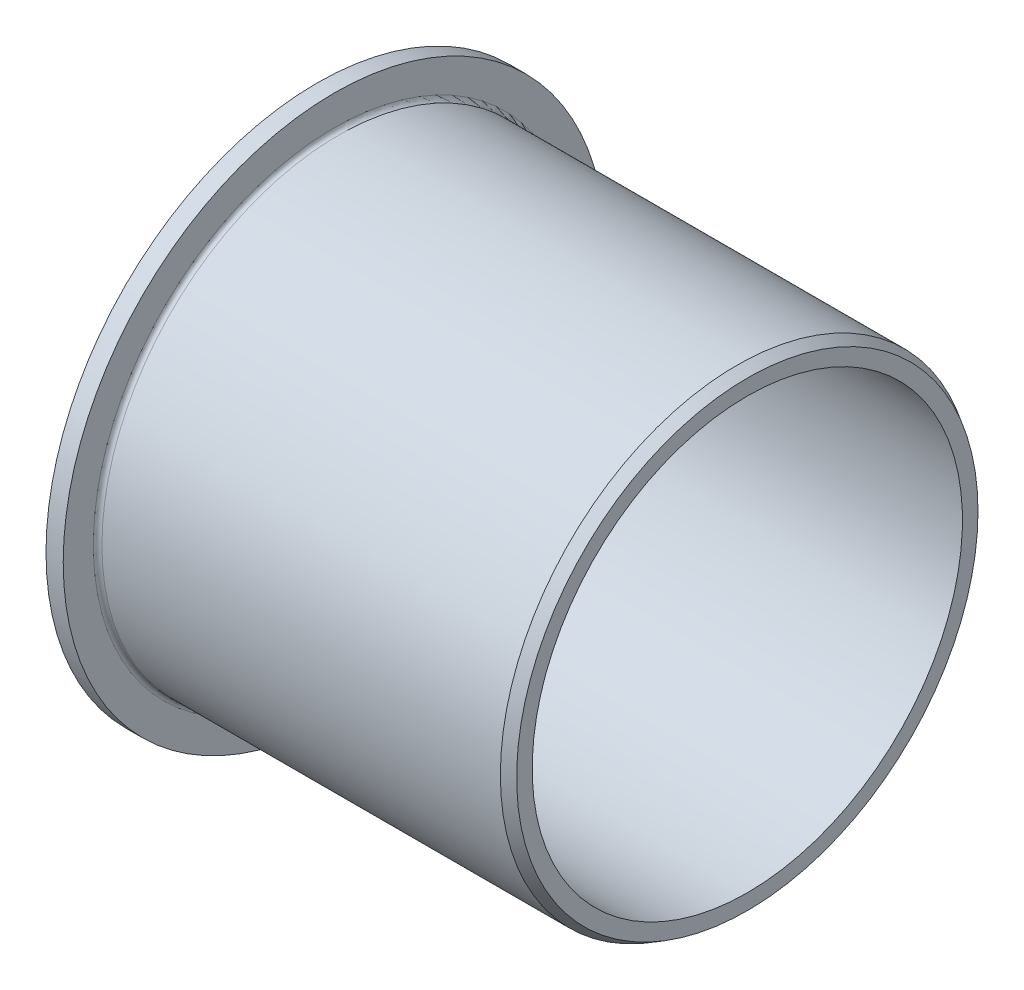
ISO-10303-21;
HEADER;
FILE_DESCRIPTION(('STEP AP214'),'2;1');
FILE_NAME('part.step','',(''),(''),'','','');
FILE_SCHEMA(('AUTOMOTIVE_DESIGN { 1 0 10303 214 1 1 1 1 }'));
ENDSEC;
DATA;
#1=APPLICATION_CONTEXT('core data for automotive mechanical design processes');
#2=APPLICATION_PROTOCOL_DEFINITION('international standard','automotive_design',2000,#1);
#3=PRODUCT_CONTEXT('',#1,'mechanical');
#4=PRODUCT('Part','Part','',(#3));
#5=PRODUCT_RELATED_PRODUCT_CATEGORY('part','',(#4));
#6=PRODUCT_DEFINITION_FORMATION('','',#4);
#7=PRODUCT_DEFINITION_CONTEXT('part definition',#1,'design');
#8=PRODUCT_DEFINITION('design','',#6,#7);
#9=PRODUCT_DEFINITION_SHAPE('','',#8);
#10=(LENGTH_UNIT() NAMED_UNIT(*) SI_UNIT(.MILLI.,.METRE.));
#11=(NAMED_UNIT(*) PLANE_ANGLE_UNIT() SI_UNIT($,.RADIAN.));
#12=(NAMED_UNIT(*) SI_UNIT($,.STERADIAN.) SOLID_ANGLE_UNIT());
#13=UNCERTAINTY_MEASURE_WITH_UNIT(LENGTH_MEASURE(1.E-05),#10,'distance_accuracy_value','');
#14=(GEOMETRIC_REPRESENTATION_CONTEXT(3) GLOBAL_UNCERTAINTY_ASSIGNED_CONTEXT((#13)) GLOBAL_UNIT_ASSIGNED_CONTEXT((#10,
#11,#12)) REPRESENTATION_CONTEXT('',''));
#15=CARTESIAN_POINT('',(0.,0.,0.));
#16=DIRECTION('',(0.,0.,1.));
#17=DIRECTION('',(1.,0.,0.));
#18=AXIS2_PLACEMENT_3D('',#15,#16,#17);
#19=CARTESIAN_POINT('',(2.,0.,0.));
#20=DIRECTION('',(1.,0.,0.));
#21=DIRECTION('',(0.,0.,1.));
#22=AXIS2_PLACEMENT_3D('',#19,#20,#21);
#23=PLANE('',#22);
#24=CARTESIAN_POINT('',(2.,0.,0.));
#25=DIRECTION('',(-1.,0.,0.));
#26=DIRECTION('',(0.,-1.,0.));
#27=AXIS2_PLACEMENT_3D('',#24,#25,#26);
#28=CIRCLE('',#27,31.5);
#29=CARTESIAN_POINT('',(2.,-31.5,0.));
#30=VERTEX_POINT('',#29);
#31=EDGE_CURVE('E21',#30,#30,#28,.T.);
#32=ORIENTED_EDGE('',*,*,#31,.F.);
#33=EDGE_LOOP('',(#32));
#34=FACE_BOUND('',#33,.T.);
#35=CARTESIAN_POINT('',(2.,0.,0.));
#36=DIRECTION('',(-1.,0.,0.));
#37=DIRECTION('',(0.,0.,-1.));
#38=AXIS2_PLACEMENT_3D('',#35,#36,#37);
#39=CIRCLE('',#38,28.);
#40=CARTESIAN_POINT('',(2.,0.,-28.));
#41=VERTEX_POINT('',#40);
#42=EDGE_CURVE('E36',#41,#41,#39,.T.);
#43=ORIENTED_EDGE('',*,*,#42,.T.);
#44=EDGE_LOOP('',(#43));
#45=FACE_BOUND('',#44,.T.);
#46=ADVANCED_FACE('F10',(#34,#45),#23,.T.);
#47=CARTESIAN_POINT('',(0.,0.,0.));
#48=DIRECTION('',(-1.,0.,0.));
#49=DIRECTION('',(0.,0.,-1.));
#50=AXIS2_PLACEMENT_3D('',#47,#48,#49);
#51=PLANE('',#50);
#52=CARTESIAN_POINT('',(0.,0.,0.));
#53=DIRECTION('',(1.,0.,0.));
#54=DIRECTION('',(0.,-1.,0.));
#55=AXIS2_PLACEMENT_3D('',#52,#53,#54);
#56=CIRCLE('',#55,27.5);
#57=CARTESIAN_POINT('',(0.,-27.5,0.));
#58=VERTEX_POINT('',#57);
#59=EDGE_CURVE('E17',#58,#58,#56,.T.);
#60=ORIENTED_EDGE('',*,*,#59,.T.);
#61=EDGE_LOOP('',(#60));
#62=FACE_BOUND('',#61,.T.);
#63=CARTESIAN_POINT('',(0.,0.,0.));
#64=DIRECTION('',(1.,0.,0.));
#65=DIRECTION('',(0.,-1.,0.));
#66=AXIS2_PLACEMENT_3D('',#63,#64,#65);
#67=CIRCLE('',#66,31.5);
#68=CARTESIAN_POINT('',(0.,-31.5,0.));
#69=VERTEX_POINT('',#68);
#70=EDGE_CURVE('E25',#69,#69,#67,.T.);
#71=ORIENTED_EDGE('',*,*,#70,.F.);
#72=EDGE_LOOP('',(#71));
#73=FACE_BOUND('',#72,.T.);
#74=ADVANCED_FACE('F61',(#62,#73),#51,.T.);
#75=CARTESIAN_POINT('',(0.,0.,0.));
#76=DIRECTION('',(1.,0.,0.));
#77=DIRECTION('',(0.,-1.,0.));
#78=AXIS2_PLACEMENT_3D('',#75,#76,#77);
#79=CYLINDRICAL_SURFACE('',#78,31.5);
#80=ORIENTED_EDGE('',*,*,#31,.T.);
#81=EDGE_LOOP('',(#80));
#82=FACE_BOUND('',#81,.T.);
#83=ORIENTED_EDGE('',*,*,#70,.T.);
#84=EDGE_LOOP('',(#83));
#85=FACE_BOUND('',#84,.T.);
#86=ADVANCED_FACE('F66',(#82,#85),#79,.T.);
#87=CARTESIAN_POINT('',(0.,0.,0.));
#88=DIRECTION('',(-1.,0.,0.));
#89=DIRECTION('',(0.,0.,-1.));
#90=AXIS2_PLACEMENT_3D('',#87,#88,#89);
#91=PLANE('',#90);
#92=CARTESIAN_POINT('',(0.,0.,0.));
#93=DIRECTION('',(1.,0.,0.));
#94=DIRECTION('',(0.,-1.,0.));
#95=AXIS2_PLACEMENT_3D('',#92,#93,#94);
#96=CIRCLE('',#95,25.);
#97=CARTESIAN_POINT('',(0.,-25.,0.));
#98=VERTEX_POINT('',#97);
#99=EDGE_CURVE('E42',#98,#98,#96,.T.);
#100=ORIENTED_EDGE('',*,*,#99,.T.);
#101=EDGE_LOOP('',(#100));
#102=FACE_BOUND('',#101,.T.);
#103=ORIENTED_EDGE('',*,*,#59,.F.);
#104=EDGE_LOOP('',(#103));
#105=FACE_BOUND('',#104,.T.);
#106=ADVANCED_FACE('F46',(#102,#105),#91,.T.);
#107=CARTESIAN_POINT('',(2.5,0.,0.));
#108=DIRECTION('',(-1.,0.,0.));
#109=DIRECTION('',(0.,0.,-1.));
#110=AXIS2_PLACEMENT_3D('',#107,#108,#109);
#111=TOROIDAL_SURFACE('',#110,28.,0.5);
#112=ORIENTED_EDGE('',*,*,#42,.F.);
#113=EDGE_LOOP('',(#112));
#114=FACE_BOUND('',#113,.T.);
#115=CARTESIAN_POINT('',(2.5,0.,0.));
#116=DIRECTION('',(1.,0.,0.));
#117=DIRECTION('',(0.,0.,1.));
#118=AXIS2_PLACEMENT_3D('',#115,#116,#117);
#119=CIRCLE('',#118,27.5);
#120=CARTESIAN_POINT('',(2.5,0.,27.5));
#121=VERTEX_POINT('',#120);
#122=EDGE_CURVE('E8',#121,#121,#119,.F.);
#123=ORIENTED_EDGE('',*,*,#122,.T.);
#124=EDGE_LOOP('',(#123));
#125=FACE_BOUND('',#124,.T.);
#126=ADVANCED_FACE('F76',(#114,#125),#111,.F.);
#127=CARTESIAN_POINT('',(50.,0.,0.));
#128=DIRECTION('',(1.,0.,0.));
#129=DIRECTION('',(0.,0.,1.));
#130=AXIS2_PLACEMENT_3D('',#127,#128,#129);
#131=PLANE('',#130);
#132=CARTESIAN_POINT('',(50.,0.,0.));
#133=DIRECTION('',(-1.,0.,0.));
#134=DIRECTION('',(0.,-1.,0.));
#135=AXIS2_PLACEMENT_3D('',#132,#133,#134);
#136=CIRCLE('',#135,25.);
#137=CARTESIAN_POINT('',(50.,-25.,0.));
#138=VERTEX_POINT('',#137);
#139=EDGE_CURVE('E39',#138,#138,#136,.T.);
#140=ORIENTED_EDGE('',*,*,#139,.T.);
#141=EDGE_LOOP('',(#140));
#142=FACE_BOUND('',#141,.T.);
#143=CARTESIAN_POINT('',(50.,0.,0.));
#144=DIRECTION('',(-1.,0.,0.));
#145=DIRECTION('',(0.,0.,-1.));
#146=AXIS2_PLACEMENT_3D('',#143,#144,#145);
#147=CIRCLE('',#146,26.8071796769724);
#148=CARTESIAN_POINT('',(50.,0.,-26.8071796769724));
#149=VERTEX_POINT('',#148);
#150=EDGE_CURVE('E33',#149,#149,#147,.T.);
#151=ORIENTED_EDGE('',*,*,#150,.F.);
#152=EDGE_LOOP('',(#151));
#153=FACE_BOUND('',#152,.T.);
#154=ADVANCED_FACE('F77',(#142,#153),#131,.T.);
#155=CARTESIAN_POINT('',(50.,0.,0.));
#156=DIRECTION('',(-1.,0.,0.));
#157=DIRECTION('',(0.,0.,-1.));
#158=AXIS2_PLACEMENT_3D('',#155,#156,#157);
#159=CONICAL_SURFACE('',#158,26.8071796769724,0.523598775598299);
#160=CARTESIAN_POINT('',(48.8,0.,0.));
#161=DIRECTION('',(-1.,0.,0.));
#162=DIRECTION('',(0.,0.,-1.));
#163=AXIS2_PLACEMENT_3D('',#160,#161,#162);
#164=CIRCLE('',#163,27.5);
#165=CARTESIAN_POINT('',(48.8,0.,-27.5));
#166=VERTEX_POINT('',#165);
#167=EDGE_CURVE('E30',#166,#166,#164,.T.);
#168=ORIENTED_EDGE('',*,*,#167,.F.);
#169=EDGE_LOOP('',(#168));
#170=FACE_BOUND('',#169,.T.);
#171=ORIENTED_EDGE('',*,*,#150,.T.);
#172=EDGE_LOOP('',(#171));
#173=FACE_BOUND('',#172,.T.);
#174=ADVANCED_FACE('F56',(#170,#173),#159,.T.);
#175=CARTESIAN_POINT('',(0.,0.,0.));
#176=DIRECTION('',(1.,0.,0.));
#177=DIRECTION('',(0.,-1.,0.));
#178=AXIS2_PLACEMENT_3D('',#175,#176,#177);
#179=CYLINDRICAL_SURFACE('',#178,27.5);
#180=ORIENTED_EDGE('',*,*,#122,.F.);
#181=EDGE_LOOP('',(#180));
#182=FACE_BOUND('',#181,.T.);
#183=ORIENTED_EDGE('',*,*,#167,.T.);
#184=EDGE_LOOP('',(#183));
#185=FACE_BOUND('',#184,.T.);
#186=ADVANCED_FACE('F12',(#182,#185),#179,.T.);
#187=CARTESIAN_POINT('',(0.,0.,0.));
#188=DIRECTION('',(1.,0.,0.));
#189=DIRECTION('',(0.,-1.,0.));
#190=AXIS2_PLACEMENT_3D('',#187,#188,#189);
#191=CYLINDRICAL_SURFACE('',#190,25.);
#192=ORIENTED_EDGE('',*,*,#139,.F.);
#193=EDGE_LOOP('',(#192));
#194=FACE_BOUND('',#193,.T.);
#195=ORIENTED_EDGE('',*,*,#99,.F.);
#196=EDGE_LOOP('',(#195));
#197=FACE_BOUND('',#196,.T.);
#198=ADVANCED_FACE('F49',(#194,#197),#191,.F.);
#199=CLOSED_SHELL('',(#46,#74,#86,#106,#126,#154,#174,#186,#198));
#200=MANIFOLD_SOLID_BREP('B1',#199);
#201=ADVANCED_BREP_SHAPE_REPRESENTATION('',(#18,#200),#14);
#202=SHAPE_DEFINITION_REPRESENTATION(#9,#201);
ENDSEC;
END-ISO-10303-21;
